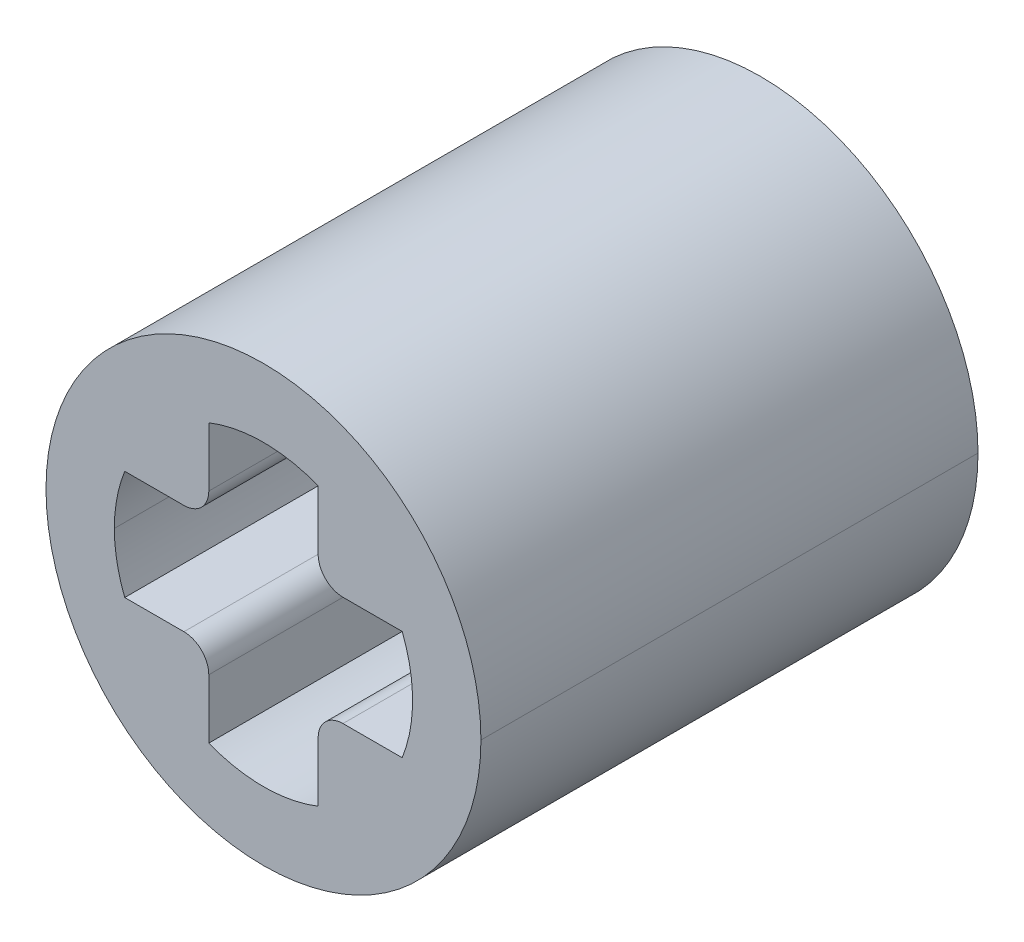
ISO-10303-21;
HEADER;
FILE_DESCRIPTION(('STEP AP214'),'2;1');
FILE_NAME('part.step','',(''),(''),'','','');
FILE_SCHEMA(('AUTOMOTIVE_DESIGN { 1 0 10303 214 1 1 1 1 }'));
ENDSEC;
DATA;
#1=APPLICATION_CONTEXT('core data for automotive mechanical design processes');
#2=APPLICATION_PROTOCOL_DEFINITION('international standard','automotive_design',2000,#1);
#3=PRODUCT_CONTEXT('',#1,'mechanical');
#4=PRODUCT('Part','Part','',(#3));
#5=PRODUCT_RELATED_PRODUCT_CATEGORY('part','',(#4));
#6=PRODUCT_DEFINITION_FORMATION('','',#4);
#7=PRODUCT_DEFINITION_CONTEXT('part definition',#1,'design');
#8=PRODUCT_DEFINITION('design','',#6,#7);
#9=PRODUCT_DEFINITION_SHAPE('','',#8);
#10=(LENGTH_UNIT() NAMED_UNIT(*) SI_UNIT(.MILLI.,.METRE.));
#11=(NAMED_UNIT(*) PLANE_ANGLE_UNIT() SI_UNIT($,.RADIAN.));
#12=(NAMED_UNIT(*) SI_UNIT($,.STERADIAN.) SOLID_ANGLE_UNIT());
#13=UNCERTAINTY_MEASURE_WITH_UNIT(LENGTH_MEASURE(1.E-05),#10,'distance_accuracy_value','');
#14=(GEOMETRIC_REPRESENTATION_CONTEXT(3) GLOBAL_UNCERTAINTY_ASSIGNED_CONTEXT((#13)) GLOBAL_UNIT_ASSIGNED_CONTEXT((#10,
#11,#12)) REPRESENTATION_CONTEXT('',''));
#15=CARTESIAN_POINT('',(0.,0.,0.));
#16=DIRECTION('',(0.,0.,1.));
#17=DIRECTION('',(1.,0.,0.));
#18=AXIS2_PLACEMENT_3D('',#15,#16,#17);
#19=CARTESIAN_POINT('',(-1.99133795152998,0.54112618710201,8.));
#20=DIRECTION('',(0.,0.,-1.));
#21=DIRECTION('',(-1.,0.,0.));
#22=AXIS2_PLACEMENT_3D('',#19,#20,#21);
#23=CYLINDRICAL_SURFACE('',#22,2.4);
#24=CARTESIAN_POINT('',(-1.99133795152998,0.54112618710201,8.));
#25=DIRECTION('',(0.,0.,1.));
#26=DIRECTION('',(1.,0.,0.));
#27=AXIS2_PLACEMENT_3D('',#24,#25,#26);
#28=CIRCLE('',#27,2.4);
#29=CARTESIAN_POINT('',(-4.22418366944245,1.42112618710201,8.));
#30=VERTEX_POINT('',#29);
#31=CARTESIAN_POINT('',(-4.39133795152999,0.54112618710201,8.));
#32=VERTEX_POINT('',#31);
#33=EDGE_CURVE('E11',#30,#32,#28,.T.);
#34=ORIENTED_EDGE('',*,*,#33,.T.);
#35=DIRECTION('',(0.,0.,-1.));
#36=VECTOR('',#35,1.);
#37=CARTESIAN_POINT('',(-4.39133795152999,0.54112618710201,8.));
#38=LINE('',#37,#36);
#39=CARTESIAN_POINT('',(-4.39133795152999,0.54112618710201,0.));
#40=VERTEX_POINT('',#39);
#41=EDGE_CURVE('E27',#32,#40,#38,.T.);
#42=ORIENTED_EDGE('',*,*,#41,.T.);
#43=CARTESIAN_POINT('',(-1.99133795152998,0.54112618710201,0.));
#44=DIRECTION('',(0.,0.,1.));
#45=DIRECTION('',(1.,0.,0.));
#46=AXIS2_PLACEMENT_3D('',#43,#44,#45);
#47=CIRCLE('',#46,2.4);
#48=CARTESIAN_POINT('',(-4.22418366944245,1.42112618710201,0.));
#49=VERTEX_POINT('',#48);
#50=EDGE_CURVE('E400',#49,#40,#47,.T.);
#51=ORIENTED_EDGE('',*,*,#50,.F.);
#52=DIRECTION('',(0.,0.,-1.));
#53=VECTOR('',#52,1.);
#54=CARTESIAN_POINT('',(-4.22418366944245,1.42112618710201,8.));
#55=LINE('',#54,#53);
#56=EDGE_CURVE('E286',#30,#49,#55,.T.);
#57=ORIENTED_EDGE('',*,*,#56,.F.);
#58=EDGE_LOOP('',(#34,#42,#51,#57));
#59=FACE_BOUND('',#58,.T.);
#60=ADVANCED_FACE('F16',(#59),#23,.F.);
#61=CARTESIAN_POINT('',(-1.99133795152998,0.54112618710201,8.));
#62=DIRECTION('',(0.,0.,-1.));
#63=DIRECTION('',(-1.,0.,0.));
#64=AXIS2_PLACEMENT_3D('',#61,#62,#63);
#65=CYLINDRICAL_SURFACE('',#64,3.5);
#66=CARTESIAN_POINT('',(-1.99133795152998,0.54112618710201,8.));
#67=DIRECTION('',(0.,0.,1.));
#68=DIRECTION('',(1.,0.,0.));
#69=AXIS2_PLACEMENT_3D('',#66,#67,#68);
#70=CIRCLE('',#69,3.5);
#71=CARTESIAN_POINT('',(1.50866204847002,0.541126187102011,8.));
#72=VERTEX_POINT('',#71);
#73=CARTESIAN_POINT('',(-5.49133795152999,0.54112618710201,8.));
#74=VERTEX_POINT('',#73);
#75=EDGE_CURVE('E332',#72,#74,#70,.T.);
#76=ORIENTED_EDGE('',*,*,#75,.F.);
#77=DIRECTION('',(0.,0.,-1.));
#78=VECTOR('',#77,1.);
#79=CARTESIAN_POINT('',(1.50866204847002,0.541126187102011,8.));
#80=LINE('',#79,#78);
#81=CARTESIAN_POINT('',(1.50866204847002,0.541126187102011,0.));
#82=VERTEX_POINT('',#81);
#83=EDGE_CURVE('E238',#72,#82,#80,.T.);
#84=ORIENTED_EDGE('',*,*,#83,.T.);
#85=CARTESIAN_POINT('',(-1.99133795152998,0.54112618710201,0.));
#86=DIRECTION('',(0.,0.,1.));
#87=DIRECTION('',(1.,0.,0.));
#88=AXIS2_PLACEMENT_3D('',#85,#86,#87);
#89=CIRCLE('',#88,3.5);
#90=CARTESIAN_POINT('',(-5.49133795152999,0.54112618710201,0.));
#91=VERTEX_POINT('',#90);
#92=EDGE_CURVE('E234',#82,#91,#89,.T.);
#93=ORIENTED_EDGE('',*,*,#92,.T.);
#94=DIRECTION('',(0.,0.,-1.));
#95=VECTOR('',#94,1.);
#96=CARTESIAN_POINT('',(-5.49133795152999,0.54112618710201,8.));
#97=LINE('',#96,#95);
#98=EDGE_CURVE('E257',#74,#91,#97,.T.);
#99=ORIENTED_EDGE('',*,*,#98,.F.);
#100=EDGE_LOOP('',(#76,#84,#93,#99));
#101=FACE_BOUND('',#100,.T.);
#102=ADVANCED_FACE('F609',(#101),#65,.T.);
#103=CARTESIAN_POINT('',(-1.99133795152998,0.54112618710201,8.));
#104=DIRECTION('',(0.,0.,1.));
#105=DIRECTION('',(1.,0.,0.));
#106=AXIS2_PLACEMENT_3D('',#103,#104,#105);
#107=PLANE('',#106);
#108=CARTESIAN_POINT('',(-1.99133795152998,0.54112618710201,8.));
#109=DIRECTION('',(0.,0.,1.));
#110=DIRECTION('',(1.,0.,0.));
#111=AXIS2_PLACEMENT_3D('',#108,#109,#110);
#112=CIRCLE('',#111,3.5);
#113=EDGE_CURVE('E239',#74,#72,#112,.T.);
#114=ORIENTED_EDGE('',*,*,#113,.T.);
#115=ORIENTED_EDGE('',*,*,#75,.T.);
#116=EDGE_LOOP('',(#114,#115));
#117=FACE_BOUND('',#116,.T.);
#118=DIRECTION('',(0.,-1.,0.));
#119=VECTOR('',#118,1.);
#120=CARTESIAN_POINT('',(-2.87133795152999,2.77397190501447,8.));
#121=LINE('',#120,#119);
#122=CARTESIAN_POINT('',(-2.87133795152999,2.77397190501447,8.));
#123=VERTEX_POINT('',#122);
#124=CARTESIAN_POINT('',(-2.87133795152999,1.82112618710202,8.));
#125=VERTEX_POINT('',#124);
#126=EDGE_CURVE('E291',#123,#125,#121,.T.);
#127=ORIENTED_EDGE('',*,*,#126,.F.);
#128=CARTESIAN_POINT('',(-1.99133795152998,0.54112618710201,8.));
#129=DIRECTION('',(0.,0.,1.));
#130=DIRECTION('',(1.,0.,0.));
#131=AXIS2_PLACEMENT_3D('',#128,#129,#130);
#132=CIRCLE('',#131,2.4);
#133=CARTESIAN_POINT('',(-1.11133795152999,2.77397190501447,8.));
#134=VERTEX_POINT('',#133);
#135=EDGE_CURVE('E312',#134,#123,#132,.T.);
#136=ORIENTED_EDGE('',*,*,#135,.F.);
#137=DIRECTION('',(0.,1.,0.));
#138=VECTOR('',#137,1.);
#139=CARTESIAN_POINT('',(-1.11133795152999,1.82112618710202,8.));
#140=LINE('',#139,#138);
#141=CARTESIAN_POINT('',(-1.11133795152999,1.82112618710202,8.));
#142=VERTEX_POINT('',#141);
#143=EDGE_CURVE('E321',#142,#134,#140,.T.);
#144=ORIENTED_EDGE('',*,*,#143,.F.);
#145=CARTESIAN_POINT('',(-0.711337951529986,1.82112618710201,8.));
#146=DIRECTION('',(0.,0.,-1.));
#147=DIRECTION('',(1.,0.,0.));
#148=AXIS2_PLACEMENT_3D('',#145,#146,#147);
#149=CIRCLE('',#148,0.4);
#150=CARTESIAN_POINT('',(-0.711337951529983,1.42112618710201,8.));
#151=VERTEX_POINT('',#150);
#152=EDGE_CURVE('E320',#151,#142,#149,.T.);
#153=ORIENTED_EDGE('',*,*,#152,.F.);
#154=DIRECTION('',(-1.,0.,0.));
#155=VECTOR('',#154,1.);
#156=CARTESIAN_POINT('',(0.241507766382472,1.42112618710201,8.));
#157=LINE('',#156,#155);
#158=CARTESIAN_POINT('',(0.241507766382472,1.42112618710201,8.));
#159=VERTEX_POINT('',#158);
#160=EDGE_CURVE('E266',#159,#151,#157,.T.);
#161=ORIENTED_EDGE('',*,*,#160,.F.);
#162=CARTESIAN_POINT('',(-1.99133795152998,0.54112618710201,8.));
#163=DIRECTION('',(0.,0.,1.));
#164=DIRECTION('',(1.,0.,0.));
#165=AXIS2_PLACEMENT_3D('',#162,#163,#164);
#166=CIRCLE('',#165,2.4);
#167=CARTESIAN_POINT('',(0.241507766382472,-0.33887381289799,8.));
#168=VERTEX_POINT('',#167);
#169=EDGE_CURVE('E307',#168,#159,#166,.T.);
#170=ORIENTED_EDGE('',*,*,#169,.F.);
#171=DIRECTION('',(1.,0.,0.));
#172=VECTOR('',#171,1.);
#173=CARTESIAN_POINT('',(-0.711337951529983,-0.33887381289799,8.));
#174=LINE('',#173,#172);
#175=CARTESIAN_POINT('',(-0.711337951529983,-0.33887381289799,8.));
#176=VERTEX_POINT('',#175);
#177=EDGE_CURVE('E188',#176,#168,#174,.T.);
#178=ORIENTED_EDGE('',*,*,#177,.F.);
#179=CARTESIAN_POINT('',(-0.711337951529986,-0.73887381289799,8.));
#180=DIRECTION('',(0.,0.,-1.));
#181=DIRECTION('',(-1.,0.,0.));
#182=AXIS2_PLACEMENT_3D('',#179,#180,#181);
#183=CIRCLE('',#182,0.4);
#184=CARTESIAN_POINT('',(-1.11133795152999,-0.738873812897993,8.));
#185=VERTEX_POINT('',#184);
#186=EDGE_CURVE('E181',#185,#176,#183,.T.);
#187=ORIENTED_EDGE('',*,*,#186,.F.);
#188=DIRECTION('',(0.,1.,0.));
#189=VECTOR('',#188,1.);
#190=CARTESIAN_POINT('',(-1.11133795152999,-1.69171953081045,8.));
#191=LINE('',#190,#189);
#192=CARTESIAN_POINT('',(-1.11133795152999,-1.69171953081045,8.));
#193=VERTEX_POINT('',#192);
#194=EDGE_CURVE('E185',#193,#185,#191,.T.);
#195=ORIENTED_EDGE('',*,*,#194,.F.);
#196=CARTESIAN_POINT('',(-1.99133795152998,0.54112618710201,8.));
#197=DIRECTION('',(0.,0.,1.));
#198=DIRECTION('',(1.,0.,0.));
#199=AXIS2_PLACEMENT_3D('',#196,#197,#198);
#200=CIRCLE('',#199,2.4);
#201=CARTESIAN_POINT('',(-2.87133795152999,-1.69171953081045,8.));
#202=VERTEX_POINT('',#201);
#203=EDGE_CURVE('E233',#202,#193,#200,.T.);
#204=ORIENTED_EDGE('',*,*,#203,.F.);
#205=DIRECTION('',(0.,-1.,0.));
#206=VECTOR('',#205,1.);
#207=CARTESIAN_POINT('',(-2.87133795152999,-0.738873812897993,8.));
#208=LINE('',#207,#206);
#209=CARTESIAN_POINT('',(-2.87133795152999,-0.738873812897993,8.));
#210=VERTEX_POINT('',#209);
#211=EDGE_CURVE('E232',#210,#202,#208,.T.);
#212=ORIENTED_EDGE('',*,*,#211,.F.);
#213=CARTESIAN_POINT('',(-3.27133795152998,-0.73887381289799,8.));
#214=DIRECTION('',(0.,0.,-1.));
#215=DIRECTION('',(1.,0.,0.));
#216=AXIS2_PLACEMENT_3D('',#213,#214,#215);
#217=CIRCLE('',#216,0.4);
#218=CARTESIAN_POINT('',(-3.27133795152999,-0.33887381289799,8.));
#219=VERTEX_POINT('',#218);
#220=EDGE_CURVE('E223',#219,#210,#217,.T.);
#221=ORIENTED_EDGE('',*,*,#220,.F.);
#222=DIRECTION('',(1.,0.,0.));
#223=VECTOR('',#222,1.);
#224=CARTESIAN_POINT('',(-4.22418366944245,-0.33887381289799,8.));
#225=LINE('',#224,#223);
#226=CARTESIAN_POINT('',(-4.22418366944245,-0.33887381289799,8.));
#227=VERTEX_POINT('',#226);
#228=EDGE_CURVE('E325',#227,#219,#225,.T.);
#229=ORIENTED_EDGE('',*,*,#228,.F.);
#230=CARTESIAN_POINT('',(-1.99133795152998,0.54112618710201,8.));
#231=DIRECTION('',(0.,0.,1.));
#232=DIRECTION('',(1.,0.,0.));
#233=AXIS2_PLACEMENT_3D('',#230,#231,#232);
#234=CIRCLE('',#233,2.4);
#235=EDGE_CURVE('E299',#32,#227,#234,.T.);
#236=ORIENTED_EDGE('',*,*,#235,.F.);
#237=ORIENTED_EDGE('',*,*,#33,.F.);
#238=DIRECTION('',(-1.,0.,0.));
#239=VECTOR('',#238,1.);
#240=CARTESIAN_POINT('',(-3.27133795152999,1.42112618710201,8.));
#241=LINE('',#240,#239);
#242=CARTESIAN_POINT('',(-3.27133795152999,1.42112618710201,8.));
#243=VERTEX_POINT('',#242);
#244=EDGE_CURVE('E281',#243,#30,#241,.T.);
#245=ORIENTED_EDGE('',*,*,#244,.F.);
#246=CARTESIAN_POINT('',(-3.27133795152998,1.82112618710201,8.));
#247=DIRECTION('',(0.,0.,-1.));
#248=DIRECTION('',(-1.,0.,0.));
#249=AXIS2_PLACEMENT_3D('',#246,#247,#248);
#250=CIRCLE('',#249,0.4);
#251=EDGE_CURVE('E337',#125,#243,#250,.T.);
#252=ORIENTED_EDGE('',*,*,#251,.F.);
#253=EDGE_LOOP('',(#127,#136,#144,#153,#161,#170,#178,#187,#195,#204,#212,#221,#229,#236,#237,
#245,#252));
#254=FACE_BOUND('',#253,.T.);
#255=ADVANCED_FACE('F183',(#117,#254),#107,.T.);
#256=CARTESIAN_POINT('',(-1.99133795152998,0.54112618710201,0.));
#257=DIRECTION('',(0.,0.,1.));
#258=DIRECTION('',(1.,0.,0.));
#259=AXIS2_PLACEMENT_3D('',#256,#257,#258);
#260=PLANE('',#259);
#261=CARTESIAN_POINT('',(-1.99133795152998,0.54112618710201,0.));
#262=DIRECTION('',(0.,0.,1.));
#263=DIRECTION('',(1.,0.,0.));
#264=AXIS2_PLACEMENT_3D('',#261,#262,#263);
#265=CIRCLE('',#264,3.5);
#266=EDGE_CURVE('E263',#91,#82,#265,.T.);
#267=ORIENTED_EDGE('',*,*,#266,.F.);
#268=ORIENTED_EDGE('',*,*,#92,.F.);
#269=EDGE_LOOP('',(#267,#268));
#270=FACE_BOUND('',#269,.T.);
#271=CARTESIAN_POINT('',(-1.99133795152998,0.54112618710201,0.));
#272=DIRECTION('',(0.,0.,1.));
#273=DIRECTION('',(1.,0.,0.));
#274=AXIS2_PLACEMENT_3D('',#271,#272,#273);
#275=CIRCLE('',#274,2.4);
#276=CARTESIAN_POINT('',(-1.11133795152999,2.77397190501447,0.));
#277=VERTEX_POINT('',#276);
#278=CARTESIAN_POINT('',(-2.87133795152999,2.77397190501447,0.));
#279=VERTEX_POINT('',#278);
#280=EDGE_CURVE('E302',#277,#279,#275,.T.);
#281=ORIENTED_EDGE('',*,*,#280,.T.);
#282=DIRECTION('',(0.,-1.,0.));
#283=VECTOR('',#282,1.);
#284=CARTESIAN_POINT('',(-2.87133795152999,2.77397190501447,0.));
#285=LINE('',#284,#283);
#286=CARTESIAN_POINT('',(-2.87133795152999,1.82112618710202,0.));
#287=VERTEX_POINT('',#286);
#288=EDGE_CURVE('E279',#279,#287,#285,.T.);
#289=ORIENTED_EDGE('',*,*,#288,.T.);
#290=CARTESIAN_POINT('',(-3.27133795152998,1.82112618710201,0.));
#291=DIRECTION('',(0.,0.,-1.));
#292=DIRECTION('',(-1.,0.,0.));
#293=AXIS2_PLACEMENT_3D('',#290,#291,#292);
#294=CIRCLE('',#293,0.4);
#295=CARTESIAN_POINT('',(-3.27133795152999,1.42112618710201,0.));
#296=VERTEX_POINT('',#295);
#297=EDGE_CURVE('E275',#287,#296,#294,.T.);
#298=ORIENTED_EDGE('',*,*,#297,.T.);
#299=DIRECTION('',(-1.,0.,0.));
#300=VECTOR('',#299,1.);
#301=CARTESIAN_POINT('',(-3.27133795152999,1.42112618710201,0.));
#302=LINE('',#301,#300);
#303=EDGE_CURVE('E280',#296,#49,#302,.T.);
#304=ORIENTED_EDGE('',*,*,#303,.T.);
#305=ORIENTED_EDGE('',*,*,#50,.T.);
#306=CARTESIAN_POINT('',(-1.99133795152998,0.54112618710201,0.));
#307=DIRECTION('',(0.,0.,1.));
#308=DIRECTION('',(1.,0.,0.));
#309=AXIS2_PLACEMENT_3D('',#306,#307,#308);
#310=CIRCLE('',#309,2.4);
#311=CARTESIAN_POINT('',(-4.22418366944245,-0.33887381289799,0.));
#312=VERTEX_POINT('',#311);
#313=EDGE_CURVE('E381',#40,#312,#310,.T.);
#314=ORIENTED_EDGE('',*,*,#313,.T.);
#315=DIRECTION('',(1.,0.,0.));
#316=VECTOR('',#315,1.);
#317=CARTESIAN_POINT('',(-4.22418366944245,-0.33887381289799,0.));
#318=LINE('',#317,#316);
#319=CARTESIAN_POINT('',(-3.27133795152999,-0.33887381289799,0.));
#320=VERTEX_POINT('',#319);
#321=EDGE_CURVE('E221',#312,#320,#318,.T.);
#322=ORIENTED_EDGE('',*,*,#321,.T.);
#323=CARTESIAN_POINT('',(-3.27133795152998,-0.73887381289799,0.));
#324=DIRECTION('',(0.,0.,-1.));
#325=DIRECTION('',(1.,0.,0.));
#326=AXIS2_PLACEMENT_3D('',#323,#324,#325);
#327=CIRCLE('',#326,0.4);
#328=CARTESIAN_POINT('',(-2.87133795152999,-0.738873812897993,0.));
#329=VERTEX_POINT('',#328);
#330=EDGE_CURVE('E217',#320,#329,#327,.T.);
#331=ORIENTED_EDGE('',*,*,#330,.T.);
#332=DIRECTION('',(0.,-1.,0.));
#333=VECTOR('',#332,1.);
#334=CARTESIAN_POINT('',(-2.87133795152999,-0.738873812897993,0.));
#335=LINE('',#334,#333);
#336=CARTESIAN_POINT('',(-2.87133795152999,-1.69171953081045,0.));
#337=VERTEX_POINT('',#336);
#338=EDGE_CURVE('E222',#329,#337,#335,.T.);
#339=ORIENTED_EDGE('',*,*,#338,.T.);
#340=CARTESIAN_POINT('',(-1.99133795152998,0.54112618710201,0.));
#341=DIRECTION('',(0.,0.,1.));
#342=DIRECTION('',(1.,0.,0.));
#343=AXIS2_PLACEMENT_3D('',#340,#341,#342);
#344=CIRCLE('',#343,2.4);
#345=CARTESIAN_POINT('',(-1.11133795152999,-1.69171953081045,0.));
#346=VERTEX_POINT('',#345);
#347=EDGE_CURVE('E341',#337,#346,#344,.T.);
#348=ORIENTED_EDGE('',*,*,#347,.T.);
#349=DIRECTION('',(0.,1.,0.));
#350=VECTOR('',#349,1.);
#351=CARTESIAN_POINT('',(-1.11133795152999,-1.69171953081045,0.));
#352=LINE('',#351,#350);
#353=CARTESIAN_POINT('',(-1.11133795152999,-0.738873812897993,0.));
#354=VERTEX_POINT('',#353);
#355=EDGE_CURVE('E324',#346,#354,#352,.T.);
#356=ORIENTED_EDGE('',*,*,#355,.T.);
#357=CARTESIAN_POINT('',(-0.711337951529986,-0.73887381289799,0.));
#358=DIRECTION('',(0.,0.,-1.));
#359=DIRECTION('',(-1.,0.,0.));
#360=AXIS2_PLACEMENT_3D('',#357,#358,#359);
#361=CIRCLE('',#360,0.4);
#362=CARTESIAN_POINT('',(-0.711337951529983,-0.33887381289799,0.));
#363=VERTEX_POINT('',#362);
#364=EDGE_CURVE('E207',#354,#363,#361,.T.);
#365=ORIENTED_EDGE('',*,*,#364,.T.);
#366=DIRECTION('',(1.,0.,0.));
#367=VECTOR('',#366,1.);
#368=CARTESIAN_POINT('',(-0.711337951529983,-0.33887381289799,0.));
#369=LINE('',#368,#367);
#370=CARTESIAN_POINT('',(0.241507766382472,-0.33887381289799,0.));
#371=VERTEX_POINT('',#370);
#372=EDGE_CURVE('E290',#363,#371,#369,.T.);
#373=ORIENTED_EDGE('',*,*,#372,.T.);
#374=CARTESIAN_POINT('',(-1.99133795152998,0.54112618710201,0.));
#375=DIRECTION('',(0.,0.,1.));
#376=DIRECTION('',(1.,0.,0.));
#377=AXIS2_PLACEMENT_3D('',#374,#375,#376);
#378=CIRCLE('',#377,2.4);
#379=CARTESIAN_POINT('',(0.241507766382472,1.42112618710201,0.));
#380=VERTEX_POINT('',#379);
#381=EDGE_CURVE('E255',#371,#380,#378,.T.);
#382=ORIENTED_EDGE('',*,*,#381,.T.);
#383=DIRECTION('',(-1.,0.,0.));
#384=VECTOR('',#383,1.);
#385=CARTESIAN_POINT('',(0.241507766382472,1.42112618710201,0.));
#386=LINE('',#385,#384);
#387=CARTESIAN_POINT('',(-0.711337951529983,1.42112618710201,0.));
#388=VERTEX_POINT('',#387);
#389=EDGE_CURVE('E245',#380,#388,#386,.T.);
#390=ORIENTED_EDGE('',*,*,#389,.T.);
#391=CARTESIAN_POINT('',(-0.711337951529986,1.82112618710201,0.));
#392=DIRECTION('',(0.,0.,-1.));
#393=DIRECTION('',(1.,0.,0.));
#394=AXIS2_PLACEMENT_3D('',#391,#392,#393);
#395=CIRCLE('',#394,0.4);
#396=CARTESIAN_POINT('',(-1.11133795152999,1.82112618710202,0.));
#397=VERTEX_POINT('',#396);
#398=EDGE_CURVE('E242',#388,#397,#395,.T.);
#399=ORIENTED_EDGE('',*,*,#398,.T.);
#400=DIRECTION('',(0.,1.,0.));
#401=VECTOR('',#400,1.);
#402=CARTESIAN_POINT('',(-1.11133795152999,1.82112618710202,0.));
#403=LINE('',#402,#401);
#404=EDGE_CURVE('E246',#397,#277,#403,.T.);
#405=ORIENTED_EDGE('',*,*,#404,.T.);
#406=EDGE_LOOP('',(#281,#289,#298,#304,#305,#314,#322,#331,#339,#348,#356,#365,#373,#382,#390,
#399,#405));
#407=FACE_BOUND('',#406,.T.);
#408=ADVANCED_FACE('F412',(#270,#407),#260,.F.);
#409=CARTESIAN_POINT('',(-1.99133795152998,0.54112618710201,8.));
#410=DIRECTION('',(0.,0.,-1.));
#411=DIRECTION('',(-1.,0.,0.));
#412=AXIS2_PLACEMENT_3D('',#409,#410,#411);
#413=CYLINDRICAL_SURFACE('',#412,3.5);
#414=ORIENTED_EDGE('',*,*,#83,.F.);
#415=ORIENTED_EDGE('',*,*,#113,.F.);
#416=ORIENTED_EDGE('',*,*,#98,.T.);
#417=ORIENTED_EDGE('',*,*,#266,.T.);
#418=EDGE_LOOP('',(#414,#415,#416,#417));
#419=FACE_BOUND('',#418,.T.);
#420=ADVANCED_FACE('F618',(#419),#413,.T.);
#421=CARTESIAN_POINT('',(-1.99133795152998,0.54112618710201,8.));
#422=DIRECTION('',(0.,0.,-1.));
#423=DIRECTION('',(-1.,0.,0.));
#424=AXIS2_PLACEMENT_3D('',#421,#422,#423);
#425=CYLINDRICAL_SURFACE('',#424,2.4);
#426=ORIENTED_EDGE('',*,*,#280,.F.);
#427=DIRECTION('',(0.,0.,-1.));
#428=VECTOR('',#427,1.);
#429=CARTESIAN_POINT('',(-1.11133795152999,2.77397190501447,8.));
#430=LINE('',#429,#428);
#431=EDGE_CURVE('E344',#134,#277,#430,.T.);
#432=ORIENTED_EDGE('',*,*,#431,.F.);
#433=ORIENTED_EDGE('',*,*,#135,.T.);
#434=DIRECTION('',(0.,0.,-1.));
#435=VECTOR('',#434,1.);
#436=CARTESIAN_POINT('',(-2.87133795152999,2.77397190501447,8.));
#437=LINE('',#436,#435);
#438=EDGE_CURVE('E295',#123,#279,#437,.T.);
#439=ORIENTED_EDGE('',*,*,#438,.T.);
#440=EDGE_LOOP('',(#426,#432,#433,#439));
#441=FACE_BOUND('',#440,.T.);
#442=ADVANCED_FACE('F616',(#441),#425,.F.);
#443=CARTESIAN_POINT('',(-2.87133795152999,2.77397190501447,8.));
#444=DIRECTION('',(1.,0.,0.));
#445=DIRECTION('',(0.,1.,0.));
#446=AXIS2_PLACEMENT_3D('',#443,#444,#445);
#447=PLANE('',#446);
#448=ORIENTED_EDGE('',*,*,#288,.F.);
#449=ORIENTED_EDGE('',*,*,#438,.F.);
#450=ORIENTED_EDGE('',*,*,#126,.T.);
#451=DIRECTION('',(0.,0.,-1.));
#452=VECTOR('',#451,1.);
#453=CARTESIAN_POINT('',(-2.87133795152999,1.82112618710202,8.));
#454=LINE('',#453,#452);
#455=EDGE_CURVE('E296',#125,#287,#454,.T.);
#456=ORIENTED_EDGE('',*,*,#455,.T.);
#457=EDGE_LOOP('',(#448,#449,#450,#456));
#458=FACE_BOUND('',#457,.T.);
#459=ADVANCED_FACE('F625',(#458),#447,.T.);
#460=CARTESIAN_POINT('',(-3.27133795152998,1.82112618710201,8.));
#461=DIRECTION('',(0.,0.,-1.));
#462=DIRECTION('',(-1.,0.,0.));
#463=AXIS2_PLACEMENT_3D('',#460,#461,#462);
#464=CYLINDRICAL_SURFACE('',#463,0.4);
#465=ORIENTED_EDGE('',*,*,#297,.F.);
#466=ORIENTED_EDGE('',*,*,#455,.F.);
#467=ORIENTED_EDGE('',*,*,#251,.T.);
#468=DIRECTION('',(0.,0.,-1.));
#469=VECTOR('',#468,1.);
#470=CARTESIAN_POINT('',(-3.27133795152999,1.42112618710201,8.));
#471=LINE('',#470,#469);
#472=EDGE_CURVE('E285',#243,#296,#471,.T.);
#473=ORIENTED_EDGE('',*,*,#472,.T.);
#474=EDGE_LOOP('',(#465,#466,#467,#473));
#475=FACE_BOUND('',#474,.T.);
#476=ADVANCED_FACE('F643',(#475),#464,.T.);
#477=CARTESIAN_POINT('',(-3.27133795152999,1.42112618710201,8.));
#478=DIRECTION('',(0.,-1.,0.));
#479=DIRECTION('',(0.,0.,-1.));
#480=AXIS2_PLACEMENT_3D('',#477,#478,#479);
#481=PLANE('',#480);
#482=ORIENTED_EDGE('',*,*,#303,.F.);
#483=ORIENTED_EDGE('',*,*,#472,.F.);
#484=ORIENTED_EDGE('',*,*,#244,.T.);
#485=ORIENTED_EDGE('',*,*,#56,.T.);
#486=EDGE_LOOP('',(#482,#483,#484,#485));
#487=FACE_BOUND('',#486,.T.);
#488=ADVANCED_FACE('F646',(#487),#481,.T.);
#489=CARTESIAN_POINT('',(-1.99133795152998,0.54112618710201,8.));
#490=DIRECTION('',(0.,0.,-1.));
#491=DIRECTION('',(-1.,0.,0.));
#492=AXIS2_PLACEMENT_3D('',#489,#490,#491);
#493=CYLINDRICAL_SURFACE('',#492,2.4);
#494=ORIENTED_EDGE('',*,*,#41,.F.);
#495=ORIENTED_EDGE('',*,*,#235,.T.);
#496=DIRECTION('',(0.,0.,-1.));
#497=VECTOR('',#496,1.);
#498=CARTESIAN_POINT('',(-4.22418366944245,-0.33887381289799,8.));
#499=LINE('',#498,#497);
#500=EDGE_CURVE('E329',#227,#312,#499,.T.);
#501=ORIENTED_EDGE('',*,*,#500,.T.);
#502=ORIENTED_EDGE('',*,*,#313,.F.);
#503=EDGE_LOOP('',(#494,#495,#501,#502));
#504=FACE_BOUND('',#503,.T.);
#505=ADVANCED_FACE('F416',(#504),#493,.F.);
#506=CARTESIAN_POINT('',(-4.22418366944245,-0.33887381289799,8.));
#507=DIRECTION('',(0.,1.,0.));
#508=DIRECTION('',(1.,0.,0.));
#509=AXIS2_PLACEMENT_3D('',#506,#507,#508);
#510=PLANE('',#509);
#511=ORIENTED_EDGE('',*,*,#321,.F.);
#512=ORIENTED_EDGE('',*,*,#500,.F.);
#513=ORIENTED_EDGE('',*,*,#228,.T.);
#514=DIRECTION('',(0.,0.,-1.));
#515=VECTOR('',#514,1.);
#516=CARTESIAN_POINT('',(-3.27133795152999,-0.33887381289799,8.));
#517=LINE('',#516,#515);
#518=EDGE_CURVE('E20',#219,#320,#517,.T.);
#519=ORIENTED_EDGE('',*,*,#518,.T.);
#520=EDGE_LOOP('',(#511,#512,#513,#519));
#521=FACE_BOUND('',#520,.T.);
#522=ADVANCED_FACE('F419',(#521),#510,.T.);
#523=CARTESIAN_POINT('',(-3.27133795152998,-0.73887381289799,8.));
#524=DIRECTION('',(0.,0.,-1.));
#525=DIRECTION('',(-1.,0.,0.));
#526=AXIS2_PLACEMENT_3D('',#523,#524,#525);
#527=CYLINDRICAL_SURFACE('',#526,0.4);
#528=ORIENTED_EDGE('',*,*,#330,.F.);
#529=ORIENTED_EDGE('',*,*,#518,.F.);
#530=ORIENTED_EDGE('',*,*,#220,.T.);
#531=DIRECTION('',(0.,0.,-1.));
#532=VECTOR('',#531,1.);
#533=CARTESIAN_POINT('',(-2.87133795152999,-0.738873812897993,8.));
#534=LINE('',#533,#532);
#535=EDGE_CURVE('E227',#210,#329,#534,.T.);
#536=ORIENTED_EDGE('',*,*,#535,.T.);
#537=EDGE_LOOP('',(#528,#529,#530,#536));
#538=FACE_BOUND('',#537,.T.);
#539=ADVANCED_FACE('F424',(#538),#527,.T.);
#540=CARTESIAN_POINT('',(-2.87133795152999,-0.738873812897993,8.));
#541=DIRECTION('',(1.,0.,0.));
#542=DIRECTION('',(0.,1.,0.));
#543=AXIS2_PLACEMENT_3D('',#540,#541,#542);
#544=PLANE('',#543);
#545=ORIENTED_EDGE('',*,*,#338,.F.);
#546=ORIENTED_EDGE('',*,*,#535,.F.);
#547=ORIENTED_EDGE('',*,*,#211,.T.);
#548=DIRECTION('',(0.,0.,-1.));
#549=VECTOR('',#548,1.);
#550=CARTESIAN_POINT('',(-2.87133795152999,-1.69171953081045,8.));
#551=LINE('',#550,#549);
#552=EDGE_CURVE('E228',#202,#337,#551,.T.);
#553=ORIENTED_EDGE('',*,*,#552,.T.);
#554=EDGE_LOOP('',(#545,#546,#547,#553));
#555=FACE_BOUND('',#554,.T.);
#556=ADVANCED_FACE('F18',(#555),#544,.T.);
#557=CARTESIAN_POINT('',(-1.99133795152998,0.54112618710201,8.));
#558=DIRECTION('',(0.,0.,-1.));
#559=DIRECTION('',(-1.,0.,0.));
#560=AXIS2_PLACEMENT_3D('',#557,#558,#559);
#561=CYLINDRICAL_SURFACE('',#560,2.4);
#562=ORIENTED_EDGE('',*,*,#347,.F.);
#563=ORIENTED_EDGE('',*,*,#552,.F.);
#564=ORIENTED_EDGE('',*,*,#203,.T.);
#565=DIRECTION('',(0.,0.,-1.));
#566=VECTOR('',#565,1.);
#567=CARTESIAN_POINT('',(-1.11133795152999,-1.69171953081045,8.));
#568=LINE('',#567,#566);
#569=EDGE_CURVE('E202',#193,#346,#568,.T.);
#570=ORIENTED_EDGE('',*,*,#569,.T.);
#571=EDGE_LOOP('',(#562,#563,#564,#570));
#572=FACE_BOUND('',#571,.T.);
#573=ADVANCED_FACE('F429',(#572),#561,.F.);
#574=CARTESIAN_POINT('',(-1.11133795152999,-1.69171953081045,8.));
#575=DIRECTION('',(-1.,0.,0.));
#576=DIRECTION('',(0.,0.,1.));
#577=AXIS2_PLACEMENT_3D('',#574,#575,#576);
#578=PLANE('',#577);
#579=ORIENTED_EDGE('',*,*,#355,.F.);
#580=ORIENTED_EDGE('',*,*,#569,.F.);
#581=ORIENTED_EDGE('',*,*,#194,.T.);
#582=DIRECTION('',(0.,0.,-1.));
#583=VECTOR('',#582,1.);
#584=CARTESIAN_POINT('',(-1.11133795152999,-0.738873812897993,8.));
#585=LINE('',#584,#583);
#586=EDGE_CURVE('E194',#185,#354,#585,.T.);
#587=ORIENTED_EDGE('',*,*,#586,.T.);
#588=EDGE_LOOP('',(#579,#580,#581,#587));
#589=FACE_BOUND('',#588,.T.);
#590=ADVANCED_FACE('F200',(#589),#578,.T.);
#591=CARTESIAN_POINT('',(-0.711337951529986,-0.73887381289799,8.));
#592=DIRECTION('',(0.,0.,-1.));
#593=DIRECTION('',(-1.,0.,0.));
#594=AXIS2_PLACEMENT_3D('',#591,#592,#593);
#595=CYLINDRICAL_SURFACE('',#594,0.4);
#596=ORIENTED_EDGE('',*,*,#364,.F.);
#597=ORIENTED_EDGE('',*,*,#586,.F.);
#598=ORIENTED_EDGE('',*,*,#186,.T.);
#599=DIRECTION('',(0.,0.,-1.));
#600=VECTOR('',#599,1.);
#601=CARTESIAN_POINT('',(-0.711337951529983,-0.33887381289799,8.));
#602=LINE('',#601,#600);
#603=EDGE_CURVE('E195',#176,#363,#602,.T.);
#604=ORIENTED_EDGE('',*,*,#603,.T.);
#605=EDGE_LOOP('',(#596,#597,#598,#604));
#606=FACE_BOUND('',#605,.T.);
#607=ADVANCED_FACE('F205',(#606),#595,.T.);
#608=CARTESIAN_POINT('',(-0.711337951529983,-0.33887381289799,8.));
#609=DIRECTION('',(0.,1.,0.));
#610=DIRECTION('',(1.,0.,0.));
#611=AXIS2_PLACEMENT_3D('',#608,#609,#610);
#612=PLANE('',#611);
#613=ORIENTED_EDGE('',*,*,#372,.F.);
#614=ORIENTED_EDGE('',*,*,#603,.F.);
#615=ORIENTED_EDGE('',*,*,#177,.T.);
#616=DIRECTION('',(0.,0.,-1.));
#617=VECTOR('',#616,1.);
#618=CARTESIAN_POINT('',(0.241507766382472,-0.33887381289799,8.));
#619=LINE('',#618,#617);
#620=EDGE_CURVE('E348',#168,#371,#619,.T.);
#621=ORIENTED_EDGE('',*,*,#620,.T.);
#622=EDGE_LOOP('',(#613,#614,#615,#621));
#623=FACE_BOUND('',#622,.T.);
#624=ADVANCED_FACE('F596',(#623),#612,.T.);
#625=CARTESIAN_POINT('',(-1.99133795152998,0.54112618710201,8.));
#626=DIRECTION('',(0.,0.,-1.));
#627=DIRECTION('',(-1.,0.,0.));
#628=AXIS2_PLACEMENT_3D('',#625,#626,#627);
#629=CYLINDRICAL_SURFACE('',#628,2.4);
#630=ORIENTED_EDGE('',*,*,#381,.F.);
#631=ORIENTED_EDGE('',*,*,#620,.F.);
#632=ORIENTED_EDGE('',*,*,#169,.T.);
#633=DIRECTION('',(0.,0.,-1.));
#634=VECTOR('',#633,1.);
#635=CARTESIAN_POINT('',(0.241507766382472,1.42112618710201,8.));
#636=LINE('',#635,#634);
#637=EDGE_CURVE('E270',#159,#380,#636,.T.);
#638=ORIENTED_EDGE('',*,*,#637,.T.);
#639=EDGE_LOOP('',(#630,#631,#632,#638));
#640=FACE_BOUND('',#639,.T.);
#641=ADVANCED_FACE('F593',(#640),#629,.F.);
#642=CARTESIAN_POINT('',(0.241507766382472,1.42112618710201,8.));
#643=DIRECTION('',(0.,-1.,0.));
#644=DIRECTION('',(0.,0.,-1.));
#645=AXIS2_PLACEMENT_3D('',#642,#643,#644);
#646=PLANE('',#645);
#647=ORIENTED_EDGE('',*,*,#389,.F.);
#648=ORIENTED_EDGE('',*,*,#637,.F.);
#649=ORIENTED_EDGE('',*,*,#160,.T.);
#650=DIRECTION('',(0.,0.,-1.));
#651=VECTOR('',#650,1.);
#652=CARTESIAN_POINT('',(-0.711337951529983,1.42112618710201,8.));
#653=LINE('',#652,#651);
#654=EDGE_CURVE('E271',#151,#388,#653,.T.);
#655=ORIENTED_EDGE('',*,*,#654,.T.);
#656=EDGE_LOOP('',(#647,#648,#649,#655));
#657=FACE_BOUND('',#656,.T.);
#658=ADVANCED_FACE('F594',(#657),#646,.T.);
#659=CARTESIAN_POINT('',(-0.711337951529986,1.82112618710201,8.));
#660=DIRECTION('',(0.,0.,-1.));
#661=DIRECTION('',(-1.,0.,0.));
#662=AXIS2_PLACEMENT_3D('',#659,#660,#661);
#663=CYLINDRICAL_SURFACE('',#662,0.4);
#664=ORIENTED_EDGE('',*,*,#398,.F.);
#665=ORIENTED_EDGE('',*,*,#654,.F.);
#666=ORIENTED_EDGE('',*,*,#152,.T.);
#667=DIRECTION('',(0.,0.,-1.));
#668=VECTOR('',#667,1.);
#669=CARTESIAN_POINT('',(-1.11133795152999,1.82112618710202,8.));
#670=LINE('',#669,#668);
#671=EDGE_CURVE('E317',#142,#397,#670,.T.);
#672=ORIENTED_EDGE('',*,*,#671,.T.);
#673=EDGE_LOOP('',(#664,#665,#666,#672));
#674=FACE_BOUND('',#673,.T.);
#675=ADVANCED_FACE('F648',(#674),#663,.T.);
#676=CARTESIAN_POINT('',(-1.11133795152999,1.82112618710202,8.));
#677=DIRECTION('',(-1.,0.,0.));
#678=DIRECTION('',(0.,0.,1.));
#679=AXIS2_PLACEMENT_3D('',#676,#677,#678);
#680=PLANE('',#679);
#681=ORIENTED_EDGE('',*,*,#404,.F.);
#682=ORIENTED_EDGE('',*,*,#671,.F.);
#683=ORIENTED_EDGE('',*,*,#143,.T.);
#684=ORIENTED_EDGE('',*,*,#431,.T.);
#685=EDGE_LOOP('',(#681,#682,#683,#684));
#686=FACE_BOUND('',#685,.T.);
#687=ADVANCED_FACE('F651',(#686),#680,.T.);
#688=CLOSED_SHELL('',(#60,#102,#255,#408,#420,#442,#459,#476,#488,#505,#522,#539,#556,#573,#590,
#607,#624,#641,#658,#675,#687));
#689=MANIFOLD_SOLID_BREP('B1',#688);
#690=ADVANCED_BREP_SHAPE_REPRESENTATION('',(#18,#689),#14);
#691=SHAPE_DEFINITION_REPRESENTATION(#9,#690);
ENDSEC;
END-ISO-10303-21;
